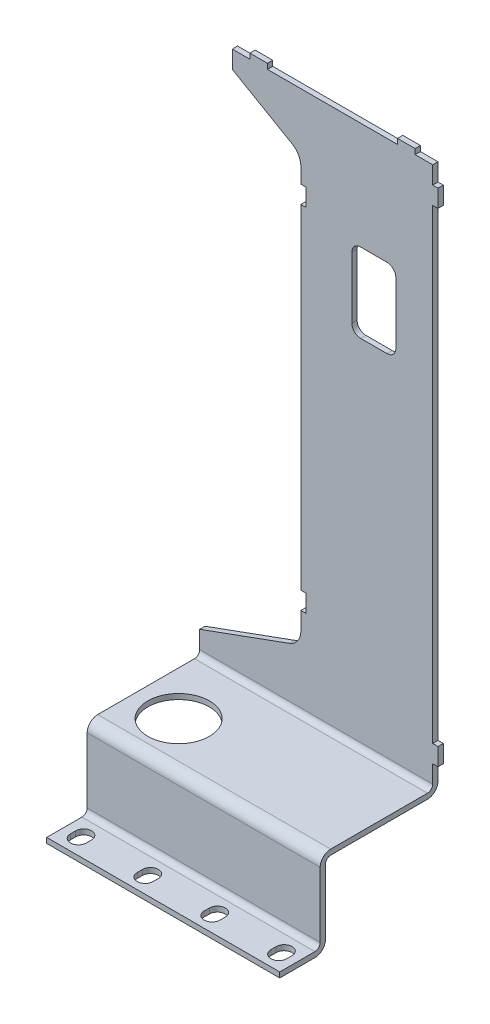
from build123d import *

# Parameters (mm, degrees)
SKETCH_1_W             = 132.5
SKETCH_1_H             = 49
EXTRUDE_1_DEPTH        = 3
SKETCH_2_W             = 23
SKETCH_2_H             = 3
EXTRUDE_2_DEPTH        = 132.5
FILLET_1_R             = 3
FILLET_2_R             = 6
CUT_EXTRUDE_1_DEPTH    = 144.642786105
PATTERN_LINEAR_1_COUNT = 4
PATTERN_LINEAR_1_PITCH = 38
EXTRUDE_3_DEPTH        = 132.5
FILLET_3_R             = 3
FILLET_4_R             = 6
SKETCH_5_R             = 17.5
CUT_EXTRUDE_2_DEPTH    = 342.344767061
CUT_EXTRUDE_3_DEPTH    = 391.60753961
EXTRUDE_4_DEPTH        = 3
SKETCH_9_W             = 3
SKETCH_9_H             = 10
EXTRUDE_5_DEPTH        = 3
SKETCH_10_W            = 10
SKETCH_10_H            = 3
EXTRUDE_6_DEPTH        = 3
FILLET_5_R             = 10
FILLET_7_R             = 10
SKETCH_11_W            = 3
SKETCH_11_H            = 10
CUT_EXTRUDE_4_DEPTH    = 396.044617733
SKETCH_12_W            = 25
SKETCH_12_H            = 45
CUT_EXTRUDE_5_DEPTH    = 396.044617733
FILLET_8_R             = 5


with BuildPart() as part:
    # Sketch 1 → Extrude 1 (new body)
    with BuildSketch(Plane.XY):
        with Locations((66.25, 24.5)):
            Rectangle(SKETCH_1_W, SKETCH_1_H)
    extrude(amount=EXTRUDE_1_DEPTH)

    # Sketch 2 → Extrude 2 (add)
    with BuildSketch(Plane.ZY):
        with Locations((14.5, 1.5)):
            Rectangle(SKETCH_2_W, SKETCH_2_H)
    extrude(amount=-EXTRUDE_2_DEPTH)

    # Fillet 1
    fillet_1_edges = [part.edges().sort_by_distance(p)[0] for p in [
        (66.25, 3, 3),
    ]]
    fillet(fillet_1_edges, radius=FILLET_1_R)

    # Fillet 2
    fillet_2_edges = [part.edges().sort_by_distance(p)[0] for p in [
        (66.25, 0, 0),
    ]]
    fillet(fillet_2_edges, radius=FILLET_2_R)

    # Sketch 3 → Cut-Extrude 1 (cut, through all)
    with BuildSketch(Plane.XZ):
        with BuildLine():
            Line((5, 14.5), (5, 17.5))
            ThreePointArc((5, 17.5), (9.5, 22), (14, 17.5))
            Line((14, 17.5), (14, 14.5))
            ThreePointArc((14, 14.5), (9.5, 10), (5, 14.5))
        make_face()
    cut_extrude_1 = extrude(amount=-CUT_EXTRUDE_1_DEPTH, mode=Mode.SUBTRACT)

    # Pattern Linear 1: Cut-Extrude 1 ×4
    with Locations(*[(i * PATTERN_LINEAR_1_PITCH, 0, 0) for i in range(1, PATTERN_LINEAR_1_COUNT)]):
        add(cut_extrude_1, mode=Mode.SUBTRACT)

    # Sketch 4 → Extrude 3 (add)
    with BuildSketch(Plane(origin=(132.5, 0, 0), x_dir=(0, 0, -1), z_dir=(1, 0, 0))):
        Polygon((0, 49), (61, 49), (61, 357), (64, 357), (64, 46), (0, 46), align=None)
    extrude(amount=-EXTRUDE_3_DEPTH)

    # Fillet 3
    fillet_3_edges = [part.edges().sort_by_distance(p)[0] for p in [
        (66.25, 46, 0),
        (66.25, 49, -61),
    ]]
    fillet(fillet_3_edges, radius=FILLET_3_R)

    # Fillet 4
    fillet_4_edges = [part.edges().sort_by_distance(p)[0] for p in [
        (66.25, 49, 3),
        (66.25, 46, -64),
    ]]
    fillet(fillet_4_edges, radius=FILLET_4_R)

    # Sketch 5 → Cut-Extrude 2 (cut, through all)
    with BuildSketch(Plane(origin=(0, 49, 0), x_dir=(1, 0, 0), z_dir=(0, 1, 0))):
        with Locations(Location((25, 24, 0), (0, 0, 270))):
            Circle(SKETCH_5_R)
    extrude(amount=-CUT_EXTRUDE_2_DEPTH, mode=Mode.SUBTRACT)

    # Sketch 6 → Cut-Extrude 3 (cut, through all)
    with BuildSketch(Plane.XY.offset(-61)):
        Polygon((0, 357), (57.5, 357), (57.5, 82.92828847), (0, 62), align=None)
    extrude(amount=-CUT_EXTRUDE_3_DEPTH, mode=Mode.SUBTRACT)

    # Sketch 7 → Extrude 4 (add)
    with BuildSketch(Plane(origin=(0, 0, -64), x_dir=(-1, 0, 0), z_dir=(0, 0, -1))):
        Polygon((-57.5, 357), (-18.5, 357), (-18.5, 347), (-57.5, 324.483339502), align=None)
    extrude(amount=-EXTRUDE_4_DEPTH)

    # Sketch 9 → Extrude 5 (add)
    with BuildSketch(Plane.XY.offset(-61)):
        with Locations((134, 342)):
            Rectangle(SKETCH_9_W, SKETCH_9_H)
        with Locations((134, 67)):
            Rectangle(SKETCH_9_W, SKETCH_9_H)
    extrude(amount=-EXTRUDE_5_DEPTH)

    # Sketch 10 → Extrude 6 (add)
    with BuildSketch(Plane.XY.offset(-61)):
        with Locations((33.5, 358.5)):
            Rectangle(SKETCH_10_W, SKETCH_10_H)
        with Locations((117.5, 358.5)):
            Rectangle(SKETCH_10_W, SKETCH_10_H)
    extrude(amount=-EXTRUDE_6_DEPTH)

    # Fillet 5
    fillet_5_edges = [part.edges().sort_by_distance(p)[0] for p in [
        (57.5, 82.92828847, -62.5),
    ]]
    fillet(fillet_5_edges, radius=FILLET_5_R)

    # Fillet 7
    fillet_7_edges = [part.edges().sort_by_distance(p)[0] for p in [
        (57.5, 324.483339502, -62.5),
    ]]
    fillet(fillet_7_edges, radius=FILLET_7_R)

    # Sketch 11 → Cut-Extrude 4 (cut, through all)
    with BuildSketch(Plane(origin=(0, 0, -64), x_dir=(-1, 0, 0), z_dir=(0, 0, -1))):
        with Locations((-59, 305)):
            Rectangle(SKETCH_11_W, SKETCH_11_H)
        with Locations((-59, 105)):
            Rectangle(SKETCH_11_W, SKETCH_11_H)
    extrude(amount=-CUT_EXTRUDE_4_DEPTH, mode=Mode.SUBTRACT)

    # Sketch 12 → Cut-Extrude 5 (cut, through all)
    with BuildSketch(Plane(origin=(0, 0, -64), x_dir=(-1, 0, 0), z_dir=(0, 0, -1))):
        with Locations((-99, 273.5)):
            Rectangle(SKETCH_12_W, SKETCH_12_H)
    extrude(amount=-CUT_EXTRUDE_5_DEPTH, mode=Mode.SUBTRACT)

    # Fillet 8
    fillet_8_edges = [part.edges().sort_by_distance(p)[0] for p in [
        (111.5, 251, -62.5),
        (111.5, 296, -62.5),
        (86.5, 296, -62.5),
        (86.5, 251, -62.5),
    ]]
    fillet(fillet_8_edges, radius=FILLET_8_R)


solid = part.part
